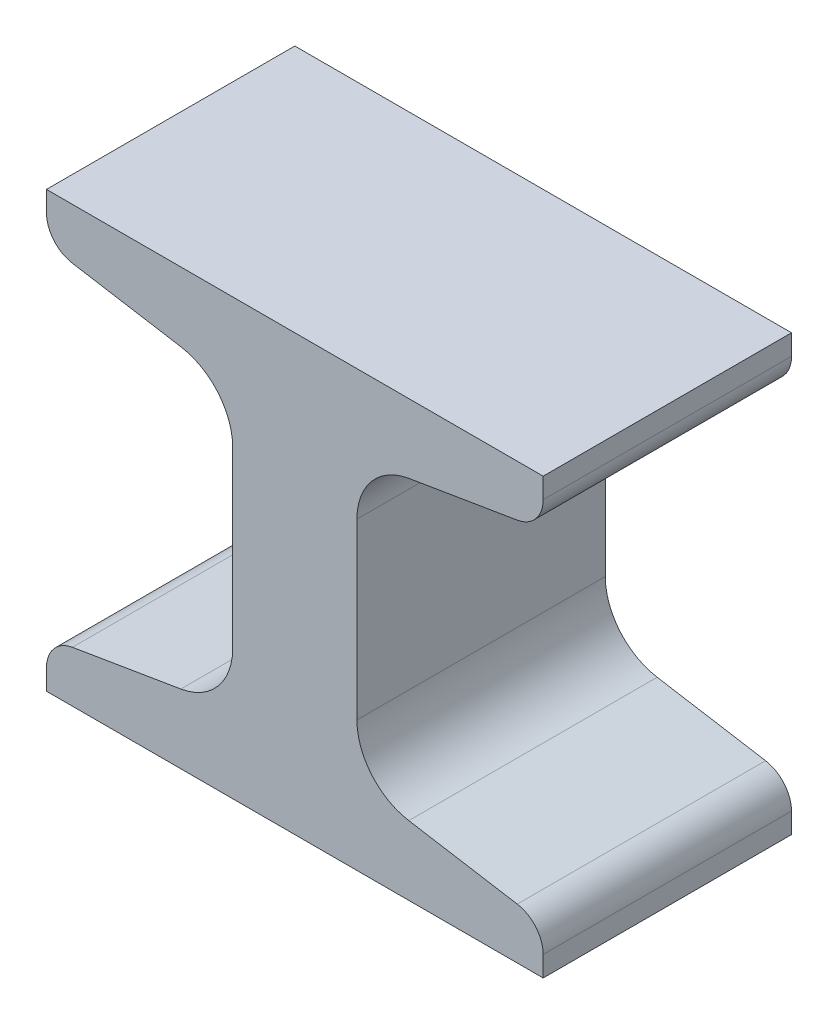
from build123d import *

# Parameters (mm, degrees)
BASESBEAM_DEPTH = 12.7
TOEFILLET_R     = 3.175


with BuildPart() as part:
    # Sketch1 → BaseSbeam (new, symmetric)
    with BuildSketch(Plane.XY):
        with BuildLine():
            Line((0, 0), (0, 4.776736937))
            Line((0, 4.776736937), (13.744007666, 7.067571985))
            ThreePointArc((13.744007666, 7.067571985), (17.545201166, 9.22670912), (19.05, 13.331161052))
            Line((19.05, 13.331161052), (19.05, 31.118838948))
            ThreePointArc((19.05, 31.118838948), (17.545201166, 35.22329088), (13.744007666, 37.382428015))
            Line((13.744007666, 37.382428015), (0, 39.673263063))
            Line((0, 39.673263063), (0, 44.45))
            Line((0, 44.45), (50.8, 44.45))
            Line((50.8, 44.45), (50.8, 39.673263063))
            Line((50.8, 39.673263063), (37.055992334, 37.382428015))
            ThreePointArc((37.055992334, 37.382428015), (33.254798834, 35.22329088), (31.75, 31.118838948))
            Line((31.75, 31.118838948), (31.75, 13.331161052))
            ThreePointArc((31.75, 13.331161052), (33.254798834, 9.22670912), (37.055992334, 7.067571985))
            Line((37.055992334, 7.067571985), (50.8, 4.776736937))
            Line((50.8, 4.776736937), (50.8, 0))
            Line((50.8, 0), (0, 0))
        make_face()
    extrude(amount=BASESBEAM_DEPTH, both=True)

    # ToeFillet
    toefillet_edges = [part.edges().sort_by_distance(p)[0] for p in [
        (50.8, 4.776736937, 0),
        (50.8, 39.673263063, 0),
        (0, 39.673263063, 0),
        (0, 4.776736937, 0),
    ]]
    fillet(toefillet_edges, radius=TOEFILLET_R)


solid = part.part
